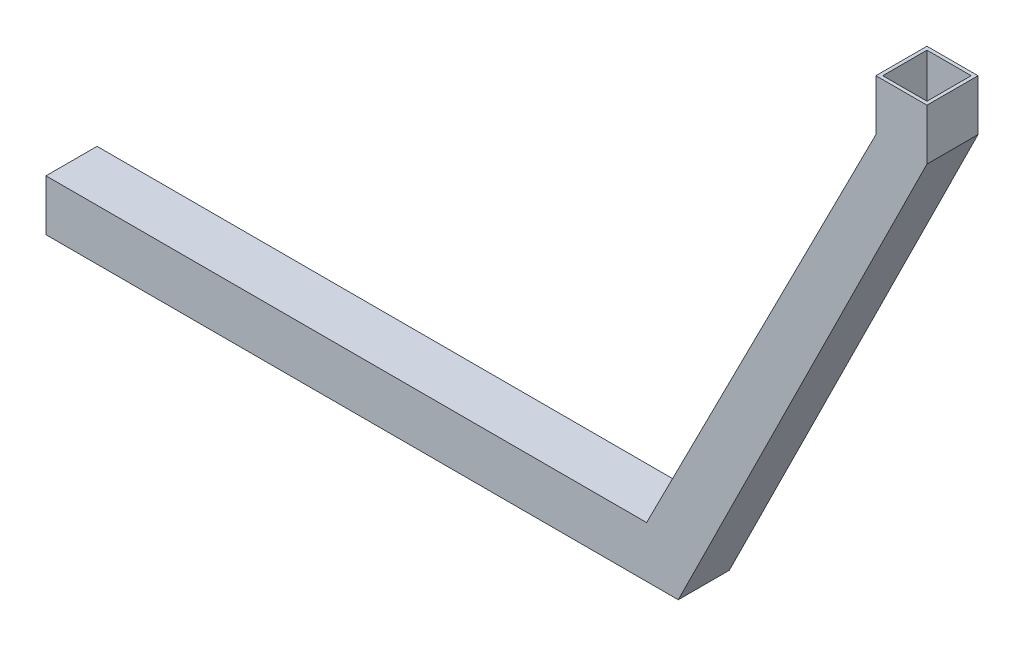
ISO-10303-21;
HEADER;
FILE_DESCRIPTION(('STEP AP214'),'2;1');
FILE_NAME('part.step','',(''),(''),'','','');
FILE_SCHEMA(('AUTOMOTIVE_DESIGN { 1 0 10303 214 1 1 1 1 }'));
ENDSEC;
DATA;
#1=APPLICATION_CONTEXT('core data for automotive mechanical design processes');
#2=APPLICATION_PROTOCOL_DEFINITION('international standard','automotive_design',2000,#1);
#3=PRODUCT_CONTEXT('',#1,'mechanical');
#4=PRODUCT('Part','Part','',(#3));
#5=PRODUCT_RELATED_PRODUCT_CATEGORY('part','',(#4));
#6=PRODUCT_DEFINITION_FORMATION('','',#4);
#7=PRODUCT_DEFINITION_CONTEXT('part definition',#1,'design');
#8=PRODUCT_DEFINITION('design','',#6,#7);
#9=PRODUCT_DEFINITION_SHAPE('','',#8);
#10=(LENGTH_UNIT() NAMED_UNIT(*) SI_UNIT(.MILLI.,.METRE.));
#11=(NAMED_UNIT(*) PLANE_ANGLE_UNIT() SI_UNIT($,.RADIAN.));
#12=(NAMED_UNIT(*) SI_UNIT($,.STERADIAN.) SOLID_ANGLE_UNIT());
#13=UNCERTAINTY_MEASURE_WITH_UNIT(LENGTH_MEASURE(1.E-05),#10,'distance_accuracy_value','');
#14=(GEOMETRIC_REPRESENTATION_CONTEXT(3) GLOBAL_UNCERTAINTY_ASSIGNED_CONTEXT((#13)) GLOBAL_UNIT_ASSIGNED_CONTEXT((#10,
#11,#12)) REPRESENTATION_CONTEXT('',''));
#15=CARTESIAN_POINT('',(0.,0.,0.));
#16=DIRECTION('',(0.,0.,1.));
#17=DIRECTION('',(1.,0.,0.));
#18=AXIS2_PLACEMENT_3D('',#15,#16,#17);
#19=CARTESIAN_POINT('',(299.885684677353,309.800000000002,30.));
#20=DIRECTION('',(0.,-1.,0.));
#21=DIRECTION('',(0.,0.,-1.));
#22=AXIS2_PLACEMENT_3D('',#19,#20,#21);
#23=PLANE('',#22);
#24=DIRECTION('',(-1.,0.,0.));
#25=VECTOR('',#24,1.);
#26=CARTESIAN_POINT('',(299.885684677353,309.800000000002,0.));
#27=LINE('',#26,#25);
#28=CARTESIAN_POINT('',(329.885684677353,309.800000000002,0.));
#29=VERTEX_POINT('',#28);
#30=CARTESIAN_POINT('',(299.885684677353,309.800000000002,0.));
#31=VERTEX_POINT('',#30);
#32=EDGE_CURVE('E246',#29,#31,#27,.T.);
#33=ORIENTED_EDGE('',*,*,#32,.T.);
#34=DIRECTION('',(0.,0.,-1.));
#35=VECTOR('',#34,1.);
#36=CARTESIAN_POINT('',(299.885684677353,309.800000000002,30.));
#37=LINE('',#36,#35);
#38=CARTESIAN_POINT('',(299.885684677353,309.800000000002,30.));
#39=VERTEX_POINT('',#38);
#40=EDGE_CURVE('E261',#39,#31,#37,.T.);
#41=ORIENTED_EDGE('',*,*,#40,.F.);
#42=DIRECTION('',(-1.,0.,0.));
#43=VECTOR('',#42,1.);
#44=CARTESIAN_POINT('',(299.885684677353,309.800000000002,30.));
#45=LINE('',#44,#43);
#46=CARTESIAN_POINT('',(329.885684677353,309.800000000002,30.));
#47=VERTEX_POINT('',#46);
#48=EDGE_CURVE('E229',#47,#39,#45,.T.);
#49=ORIENTED_EDGE('',*,*,#48,.F.);
#50=DIRECTION('',(0.,0.,-1.));
#51=VECTOR('',#50,1.);
#52=CARTESIAN_POINT('',(329.885684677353,309.800000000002,30.));
#53=LINE('',#52,#51);
#54=EDGE_CURVE('E264',#47,#29,#53,.T.);
#55=ORIENTED_EDGE('',*,*,#54,.T.);
#56=EDGE_LOOP('',(#33,#41,#49,#55));
#57=FACE_BOUND('',#56,.T.);
#58=DIRECTION('',(-1.,0.,0.));
#59=VECTOR('',#58,1.);
#60=CARTESIAN_POINT('',(299.885684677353,309.800000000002,2.));
#61=LINE('',#60,#59);
#62=CARTESIAN_POINT('',(327.885684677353,309.800000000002,2.));
#63=VERTEX_POINT('',#62);
#64=CARTESIAN_POINT('',(301.885684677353,309.800000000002,2.));
#65=VERTEX_POINT('',#64);
#66=EDGE_CURVE('E193',#63,#65,#61,.T.);
#67=ORIENTED_EDGE('',*,*,#66,.F.);
#68=DIRECTION('',(0.,0.,-1.));
#69=VECTOR('',#68,1.);
#70=CARTESIAN_POINT('',(327.885684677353,309.800000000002,30.));
#71=LINE('',#70,#69);
#72=CARTESIAN_POINT('',(327.885684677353,309.800000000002,28.));
#73=VERTEX_POINT('',#72);
#74=EDGE_CURVE('E189',#73,#63,#71,.T.);
#75=ORIENTED_EDGE('',*,*,#74,.F.);
#76=DIRECTION('',(-1.,0.,0.));
#77=VECTOR('',#76,1.);
#78=CARTESIAN_POINT('',(299.885684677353,309.800000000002,28.));
#79=LINE('',#78,#77);
#80=CARTESIAN_POINT('',(301.885684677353,309.800000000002,28.));
#81=VERTEX_POINT('',#80);
#82=EDGE_CURVE('E63',#73,#81,#79,.T.);
#83=ORIENTED_EDGE('',*,*,#82,.T.);
#84=DIRECTION('',(0.,0.,-1.));
#85=VECTOR('',#84,1.);
#86=CARTESIAN_POINT('',(301.885684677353,309.800000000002,30.));
#87=LINE('',#86,#85);
#88=EDGE_CURVE('E208',#81,#65,#87,.T.);
#89=ORIENTED_EDGE('',*,*,#88,.T.);
#90=EDGE_LOOP('',(#67,#75,#83,#89));
#91=FACE_BOUND('',#90,.T.);
#92=ADVANCED_FACE('F40',(#57,#91),#23,.F.);
#93=CARTESIAN_POINT('',(-187.814315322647,-14.999999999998,30.));
#94=DIRECTION('',(1.,0.,0.));
#95=DIRECTION('',(0.,0.,-1.));
#96=AXIS2_PLACEMENT_3D('',#93,#94,#95);
#97=PLANE('',#96);
#98=DIRECTION('',(0.,0.,1.));
#99=VECTOR('',#98,1.);
#100=CARTESIAN_POINT('',(-187.814315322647,-12.999999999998,28.));
#101=LINE('',#100,#99);
#102=CARTESIAN_POINT('',(-187.814315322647,-12.9999999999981,2.));
#103=VERTEX_POINT('',#102);
#104=CARTESIAN_POINT('',(-187.814315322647,-12.999999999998,28.));
#105=VERTEX_POINT('',#104);
#106=EDGE_CURVE('E166',#103,#105,#101,.T.);
#107=ORIENTED_EDGE('',*,*,#106,.F.);
#108=DIRECTION('',(0.,-1.,0.));
#109=VECTOR('',#108,1.);
#110=CARTESIAN_POINT('',(-187.814315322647,-12.9999999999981,2.));
#111=LINE('',#110,#109);
#112=CARTESIAN_POINT('',(-187.814315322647,13.0000000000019,2.));
#113=VERTEX_POINT('',#112);
#114=EDGE_CURVE('E170',#113,#103,#111,.T.);
#115=ORIENTED_EDGE('',*,*,#114,.F.);
#116=DIRECTION('',(0.,0.,-1.));
#117=VECTOR('',#116,1.);
#118=CARTESIAN_POINT('',(-187.814315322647,13.0000000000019,28.));
#119=LINE('',#118,#117);
#120=CARTESIAN_POINT('',(-187.814315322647,13.0000000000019,28.));
#121=VERTEX_POINT('',#120);
#122=EDGE_CURVE('E174',#121,#113,#119,.T.);
#123=ORIENTED_EDGE('',*,*,#122,.F.);
#124=DIRECTION('',(0.,1.,0.));
#125=VECTOR('',#124,1.);
#126=CARTESIAN_POINT('',(-187.814315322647,-12.999999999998,28.));
#127=LINE('',#126,#125);
#128=EDGE_CURVE('E159',#105,#121,#127,.T.);
#129=ORIENTED_EDGE('',*,*,#128,.F.);
#130=EDGE_LOOP('',(#107,#115,#123,#129));
#131=FACE_BOUND('',#130,.T.);
#132=DIRECTION('',(0.,-1.,0.));
#133=VECTOR('',#132,1.);
#134=CARTESIAN_POINT('',(-187.814315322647,-14.999999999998,0.));
#135=LINE('',#134,#133);
#136=CARTESIAN_POINT('',(-187.814315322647,15.0000000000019,0.));
#137=VERTEX_POINT('',#136);
#138=CARTESIAN_POINT('',(-187.814315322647,-14.999999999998,0.));
#139=VERTEX_POINT('',#138);
#140=EDGE_CURVE('E182',#137,#139,#135,.T.);
#141=ORIENTED_EDGE('',*,*,#140,.T.);
#142=DIRECTION('',(0.,0.,-1.));
#143=VECTOR('',#142,1.);
#144=CARTESIAN_POINT('',(-187.814315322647,-14.999999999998,30.));
#145=LINE('',#144,#143);
#146=CARTESIAN_POINT('',(-187.814315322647,-14.999999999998,30.));
#147=VERTEX_POINT('',#146);
#148=EDGE_CURVE('E11',#147,#139,#145,.T.);
#149=ORIENTED_EDGE('',*,*,#148,.F.);
#150=DIRECTION('',(0.,-1.,0.));
#151=VECTOR('',#150,1.);
#152=CARTESIAN_POINT('',(-187.814315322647,-14.999999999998,30.));
#153=LINE('',#152,#151);
#154=CARTESIAN_POINT('',(-187.814315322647,15.0000000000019,30.));
#155=VERTEX_POINT('',#154);
#156=EDGE_CURVE('E219',#155,#147,#153,.T.);
#157=ORIENTED_EDGE('',*,*,#156,.F.);
#158=DIRECTION('',(0.,0.,-1.));
#159=VECTOR('',#158,1.);
#160=CARTESIAN_POINT('',(-187.814315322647,15.0000000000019,30.));
#161=LINE('',#160,#159);
#162=EDGE_CURVE('E237',#155,#137,#161,.T.);
#163=ORIENTED_EDGE('',*,*,#162,.T.);
#164=EDGE_LOOP('',(#141,#149,#157,#163));
#165=FACE_BOUND('',#164,.T.);
#166=ADVANCED_FACE('F42',(#131,#165),#97,.F.);
#167=CARTESIAN_POINT('',(142.457793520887,-14.999999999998,30.));
#168=DIRECTION('',(0.,1.,0.));
#169=DIRECTION('',(-1.,0.,0.));
#170=AXIS2_PLACEMENT_3D('',#167,#168,#169);
#171=PLANE('',#170);
#172=DIRECTION('',(1.,0.,0.));
#173=VECTOR('',#172,1.);
#174=CARTESIAN_POINT('',(142.457793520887,-14.999999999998,0.));
#175=LINE('',#174,#173);
#176=CARTESIAN_POINT('',(183.748297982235,-14.999999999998,0.));
#177=VERTEX_POINT('',#176);
#178=EDGE_CURVE('E240',#139,#177,#175,.T.);
#179=ORIENTED_EDGE('',*,*,#178,.T.);
#180=DIRECTION('',(0.,0.,-1.));
#181=VECTOR('',#180,1.);
#182=CARTESIAN_POINT('',(183.748297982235,-14.999999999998,30.));
#183=LINE('',#182,#181);
#184=CARTESIAN_POINT('',(183.748297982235,-14.999999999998,30.));
#185=VERTEX_POINT('',#184);
#186=EDGE_CURVE('E48',#185,#177,#183,.T.);
#187=ORIENTED_EDGE('',*,*,#186,.F.);
#188=DIRECTION('',(1.,0.,0.));
#189=VECTOR('',#188,1.);
#190=CARTESIAN_POINT('',(142.457793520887,-14.999999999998,30.));
#191=LINE('',#190,#189);
#192=EDGE_CURVE('E222',#147,#185,#191,.T.);
#193=ORIENTED_EDGE('',*,*,#192,.F.);
#194=ORIENTED_EDGE('',*,*,#148,.T.);
#195=EDGE_LOOP('',(#179,#187,#193,#194));
#196=FACE_BOUND('',#195,.T.);
#197=ADVANCED_FACE('F297',(#196),#171,.F.);
#198=CARTESIAN_POINT('',(183.748297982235,-14.999999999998,30.));
#199=DIRECTION('',(-0.895956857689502,0.444141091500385,0.));
#200=DIRECTION('',(-0.444141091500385,-0.895956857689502,0.));
#201=AXIS2_PLACEMENT_3D('',#198,#199,#200);
#202=PLANE('',#201);
#203=DIRECTION('',(0.444141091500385,0.895956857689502,0.));
#204=VECTOR('',#203,1.);
#205=CARTESIAN_POINT('',(183.748297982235,-14.999999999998,0.));
#206=LINE('',#205,#204);
#207=CARTESIAN_POINT('',(329.885684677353,279.800000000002,0.));
#208=VERTEX_POINT('',#207);
#209=EDGE_CURVE('E242',#177,#208,#206,.T.);
#210=ORIENTED_EDGE('',*,*,#209,.T.);
#211=DIRECTION('',(0.,0.,-1.));
#212=VECTOR('',#211,1.);
#213=CARTESIAN_POINT('',(329.885684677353,279.800000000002,30.));
#214=LINE('',#213,#212);
#215=CARTESIAN_POINT('',(329.885684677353,279.800000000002,30.));
#216=VERTEX_POINT('',#215);
#217=EDGE_CURVE('E267',#216,#208,#214,.T.);
#218=ORIENTED_EDGE('',*,*,#217,.F.);
#219=DIRECTION('',(0.444141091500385,0.895956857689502,0.));
#220=VECTOR('',#219,1.);
#221=CARTESIAN_POINT('',(183.748297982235,-14.999999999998,30.));
#222=LINE('',#221,#220);
#223=EDGE_CURVE('E225',#185,#216,#222,.T.);
#224=ORIENTED_EDGE('',*,*,#223,.F.);
#225=ORIENTED_EDGE('',*,*,#186,.T.);
#226=EDGE_LOOP('',(#210,#218,#224,#225));
#227=FACE_BOUND('',#226,.T.);
#228=ADVANCED_FACE('F274',(#227),#202,.F.);
#229=CARTESIAN_POINT('',(329.885684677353,309.800000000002,30.));
#230=DIRECTION('',(-1.,0.,0.));
#231=DIRECTION('',(0.,-1.,0.));
#232=AXIS2_PLACEMENT_3D('',#229,#230,#231);
#233=PLANE('',#232);
#234=DIRECTION('',(0.,1.,0.));
#235=VECTOR('',#234,1.);
#236=CARTESIAN_POINT('',(329.885684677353,309.800000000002,0.));
#237=LINE('',#236,#235);
#238=EDGE_CURVE('E244',#208,#29,#237,.T.);
#239=ORIENTED_EDGE('',*,*,#238,.T.);
#240=ORIENTED_EDGE('',*,*,#54,.F.);
#241=DIRECTION('',(0.,1.,0.));
#242=VECTOR('',#241,1.);
#243=CARTESIAN_POINT('',(329.885684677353,309.800000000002,30.));
#244=LINE('',#243,#242);
#245=EDGE_CURVE('E227',#216,#47,#244,.T.);
#246=ORIENTED_EDGE('',*,*,#245,.F.);
#247=ORIENTED_EDGE('',*,*,#217,.T.);
#248=EDGE_LOOP('',(#239,#240,#246,#247));
#249=FACE_BOUND('',#248,.T.);
#250=ADVANCED_FACE('F285',(#249),#233,.F.);
#251=CARTESIAN_POINT('',(299.885684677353,279.800000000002,30.));
#252=DIRECTION('',(1.,0.,0.));
#253=DIRECTION('',(0.,0.,-1.));
#254=AXIS2_PLACEMENT_3D('',#251,#252,#253);
#255=PLANE('',#254);
#256=DIRECTION('',(0.,-1.,0.));
#257=VECTOR('',#256,1.);
#258=CARTESIAN_POINT('',(299.885684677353,279.800000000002,0.));
#259=LINE('',#258,#257);
#260=CARTESIAN_POINT('',(299.885684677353,279.800000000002,0.));
#261=VERTEX_POINT('',#260);
#262=EDGE_CURVE('E248',#31,#261,#259,.T.);
#263=ORIENTED_EDGE('',*,*,#262,.T.);
#264=DIRECTION('',(0.,0.,-1.));
#265=VECTOR('',#264,1.);
#266=CARTESIAN_POINT('',(299.885684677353,279.800000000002,30.));
#267=LINE('',#266,#265);
#268=CARTESIAN_POINT('',(299.885684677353,279.800000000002,30.));
#269=VERTEX_POINT('',#268);
#270=EDGE_CURVE('E258',#269,#261,#267,.T.);
#271=ORIENTED_EDGE('',*,*,#270,.F.);
#272=DIRECTION('',(0.,-1.,0.));
#273=VECTOR('',#272,1.);
#274=CARTESIAN_POINT('',(299.885684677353,279.800000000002,30.));
#275=LINE('',#274,#273);
#276=EDGE_CURVE('E231',#39,#269,#275,.T.);
#277=ORIENTED_EDGE('',*,*,#276,.F.);
#278=ORIENTED_EDGE('',*,*,#40,.T.);
#279=EDGE_LOOP('',(#263,#271,#277,#278));
#280=FACE_BOUND('',#279,.T.);
#281=ADVANCED_FACE('F309',(#280),#255,.F.);
#282=CARTESIAN_POINT('',(299.885684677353,279.800000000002,30.));
#283=DIRECTION('',(0.891241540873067,-0.45352895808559,0.));
#284=DIRECTION('',(0.45352895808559,0.891241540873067,0.));
#285=AXIS2_PLACEMENT_3D('',#282,#283,#284);
#286=PLANE('',#285);
#287=DIRECTION('',(-0.45352895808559,-0.891241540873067,0.));
#288=VECTOR('',#287,1.);
#289=CARTESIAN_POINT('',(299.885684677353,279.800000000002,0.));
#290=LINE('',#289,#288);
#291=CARTESIAN_POINT('',(165.136054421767,15.000000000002,0.));
#292=VERTEX_POINT('',#291);
#293=EDGE_CURVE('E250',#261,#292,#290,.T.);
#294=ORIENTED_EDGE('',*,*,#293,.T.);
#295=DIRECTION('',(0.,0.,-1.));
#296=VECTOR('',#295,1.);
#297=CARTESIAN_POINT('',(165.136054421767,15.000000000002,30.));
#298=LINE('',#297,#296);
#299=CARTESIAN_POINT('',(165.136054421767,15.000000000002,30.));
#300=VERTEX_POINT('',#299);
#301=EDGE_CURVE('E255',#300,#292,#298,.T.);
#302=ORIENTED_EDGE('',*,*,#301,.F.);
#303=DIRECTION('',(-0.45352895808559,-0.891241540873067,0.));
#304=VECTOR('',#303,1.);
#305=CARTESIAN_POINT('',(299.885684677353,279.800000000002,30.));
#306=LINE('',#305,#304);
#307=EDGE_CURVE('E233',#269,#300,#306,.T.);
#308=ORIENTED_EDGE('',*,*,#307,.F.);
#309=ORIENTED_EDGE('',*,*,#270,.T.);
#310=EDGE_LOOP('',(#294,#302,#308,#309));
#311=FACE_BOUND('',#310,.T.);
#312=ADVANCED_FACE('F307',(#311),#286,.F.);
#313=CARTESIAN_POINT('',(165.136054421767,15.000000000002,30.));
#314=DIRECTION('',(0.,-1.,0.));
#315=DIRECTION('',(1.,0.,0.));
#316=AXIS2_PLACEMENT_3D('',#313,#314,#315);
#317=PLANE('',#316);
#318=DIRECTION('',(-1.,0.,0.));
#319=VECTOR('',#318,1.);
#320=CARTESIAN_POINT('',(165.136054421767,15.000000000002,0.));
#321=LINE('',#320,#319);
#322=EDGE_CURVE('E223',#292,#137,#321,.T.);
#323=ORIENTED_EDGE('',*,*,#322,.T.);
#324=ORIENTED_EDGE('',*,*,#162,.F.);
#325=DIRECTION('',(-1.,0.,0.));
#326=VECTOR('',#325,1.);
#327=CARTESIAN_POINT('',(165.136054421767,15.000000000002,30.));
#328=LINE('',#327,#326);
#329=EDGE_CURVE('E235',#300,#155,#328,.T.);
#330=ORIENTED_EDGE('',*,*,#329,.F.);
#331=ORIENTED_EDGE('',*,*,#301,.T.);
#332=EDGE_LOOP('',(#323,#324,#330,#331));
#333=FACE_BOUND('',#332,.T.);
#334=ADVANCED_FACE('F302',(#333),#317,.F.);
#335=CARTESIAN_POINT('',(0.,0.,30.));
#336=DIRECTION('',(0.,0.,1.));
#337=DIRECTION('',(1.,0.,0.));
#338=AXIS2_PLACEMENT_3D('',#335,#336,#337);
#339=PLANE('',#338);
#340=ORIENTED_EDGE('',*,*,#156,.T.);
#341=ORIENTED_EDGE('',*,*,#192,.T.);
#342=ORIENTED_EDGE('',*,*,#223,.T.);
#343=ORIENTED_EDGE('',*,*,#245,.T.);
#344=ORIENTED_EDGE('',*,*,#48,.T.);
#345=ORIENTED_EDGE('',*,*,#276,.T.);
#346=ORIENTED_EDGE('',*,*,#307,.T.);
#347=ORIENTED_EDGE('',*,*,#329,.T.);
#348=EDGE_LOOP('',(#340,#341,#342,#343,#344,#345,#346,#347));
#349=FACE_BOUND('',#348,.T.);
#350=ADVANCED_FACE('F293',(#349),#339,.T.);
#351=CARTESIAN_POINT('',(0.,0.,0.));
#352=DIRECTION('',(0.,0.,1.));
#353=DIRECTION('',(1.,0.,0.));
#354=AXIS2_PLACEMENT_3D('',#351,#352,#353);
#355=PLANE('',#354);
#356=ORIENTED_EDGE('',*,*,#140,.F.);
#357=ORIENTED_EDGE('',*,*,#322,.F.);
#358=ORIENTED_EDGE('',*,*,#293,.F.);
#359=ORIENTED_EDGE('',*,*,#262,.F.);
#360=ORIENTED_EDGE('',*,*,#32,.F.);
#361=ORIENTED_EDGE('',*,*,#238,.F.);
#362=ORIENTED_EDGE('',*,*,#209,.F.);
#363=ORIENTED_EDGE('',*,*,#178,.F.);
#364=EDGE_LOOP('',(#356,#357,#358,#359,#360,#361,#362,#363));
#365=FACE_BOUND('',#364,.T.);
#366=ADVANCED_FACE('F280',(#365),#355,.F.);
#367=CARTESIAN_POINT('',(142.457793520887,-12.999999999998,30.));
#368=DIRECTION('',(0.,1.,0.));
#369=DIRECTION('',(-1.,0.,0.));
#370=AXIS2_PLACEMENT_3D('',#367,#368,#369);
#371=PLANE('',#370);
#372=DIRECTION('',(1.,0.,0.));
#373=VECTOR('',#372,1.);
#374=CARTESIAN_POINT('',(142.457793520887,-12.999999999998,28.));
#375=LINE('',#374,#373);
#376=CARTESIAN_POINT('',(182.50748174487,-12.999999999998,28.));
#377=VERTEX_POINT('',#376);
#378=EDGE_CURVE('E155',#105,#377,#375,.T.);
#379=ORIENTED_EDGE('',*,*,#378,.T.);
#380=DIRECTION('',(0.,0.,-1.));
#381=VECTOR('',#380,1.);
#382=CARTESIAN_POINT('',(182.50748174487,-12.999999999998,30.));
#383=LINE('',#382,#381);
#384=CARTESIAN_POINT('',(182.50748174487,-12.999999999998,2.));
#385=VERTEX_POINT('',#384);
#386=EDGE_CURVE('E181',#377,#385,#383,.T.);
#387=ORIENTED_EDGE('',*,*,#386,.T.);
#388=DIRECTION('',(1.,0.,0.));
#389=VECTOR('',#388,1.);
#390=CARTESIAN_POINT('',(142.457793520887,-12.999999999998,2.));
#391=LINE('',#390,#389);
#392=EDGE_CURVE('E55',#103,#385,#391,.T.);
#393=ORIENTED_EDGE('',*,*,#392,.F.);
#394=ORIENTED_EDGE('',*,*,#106,.T.);
#395=EDGE_LOOP('',(#379,#387,#393,#394));
#396=FACE_BOUND('',#395,.T.);
#397=ADVANCED_FACE('F167',(#396),#371,.T.);
#398=CARTESIAN_POINT('',(181.956384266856,-14.1117178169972,30.));
#399=DIRECTION('',(-0.895956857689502,0.444141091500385,0.));
#400=DIRECTION('',(-0.444141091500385,-0.895956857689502,0.));
#401=AXIS2_PLACEMENT_3D('',#398,#399,#400);
#402=PLANE('',#401);
#403=DIRECTION('',(0.444141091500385,0.895956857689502,0.));
#404=VECTOR('',#403,1.);
#405=CARTESIAN_POINT('',(181.956384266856,-14.1117178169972,2.));
#406=LINE('',#405,#404);
#407=CARTESIAN_POINT('',(327.885684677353,280.268513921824,2.));
#408=VERTEX_POINT('',#407);
#409=EDGE_CURVE('E180',#385,#408,#406,.T.);
#410=ORIENTED_EDGE('',*,*,#409,.F.);
#411=ORIENTED_EDGE('',*,*,#386,.F.);
#412=DIRECTION('',(0.444141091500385,0.895956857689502,0.));
#413=VECTOR('',#412,1.);
#414=CARTESIAN_POINT('',(181.956384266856,-14.1117178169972,28.));
#415=LINE('',#414,#413);
#416=CARTESIAN_POINT('',(327.885684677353,280.268513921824,28.));
#417=VERTEX_POINT('',#416);
#418=EDGE_CURVE('E161',#377,#417,#415,.T.);
#419=ORIENTED_EDGE('',*,*,#418,.T.);
#420=DIRECTION('',(0.,0.,-1.));
#421=VECTOR('',#420,1.);
#422=CARTESIAN_POINT('',(327.885684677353,280.268513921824,30.));
#423=LINE('',#422,#421);
#424=EDGE_CURVE('E183',#417,#408,#423,.T.);
#425=ORIENTED_EDGE('',*,*,#424,.T.);
#426=EDGE_LOOP('',(#410,#411,#419,#425));
#427=FACE_BOUND('',#426,.T.);
#428=ADVANCED_FACE('F384',(#427),#402,.T.);
#429=CARTESIAN_POINT('',(327.885684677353,309.800000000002,30.));
#430=DIRECTION('',(-1.,0.,0.));
#431=DIRECTION('',(0.,-1.,0.));
#432=AXIS2_PLACEMENT_3D('',#429,#430,#431);
#433=PLANE('',#432);
#434=DIRECTION('',(0.,1.,0.));
#435=VECTOR('',#434,1.);
#436=CARTESIAN_POINT('',(327.885684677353,309.800000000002,2.));
#437=LINE('',#436,#435);
#438=EDGE_CURVE('E186',#408,#63,#437,.T.);
#439=ORIENTED_EDGE('',*,*,#438,.F.);
#440=ORIENTED_EDGE('',*,*,#424,.F.);
#441=DIRECTION('',(0.,1.,0.));
#442=VECTOR('',#441,1.);
#443=CARTESIAN_POINT('',(327.885684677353,309.800000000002,28.));
#444=LINE('',#443,#442);
#445=EDGE_CURVE('E191',#417,#73,#444,.T.);
#446=ORIENTED_EDGE('',*,*,#445,.T.);
#447=ORIENTED_EDGE('',*,*,#74,.T.);
#448=EDGE_LOOP('',(#439,#440,#446,#447));
#449=FACE_BOUND('',#448,.T.);
#450=ADVANCED_FACE('F389',(#449),#433,.T.);
#451=CARTESIAN_POINT('',(301.885684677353,279.800000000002,30.));
#452=DIRECTION('',(1.,0.,0.));
#453=DIRECTION('',(0.,0.,-1.));
#454=AXIS2_PLACEMENT_3D('',#451,#452,#453);
#455=PLANE('',#454);
#456=DIRECTION('',(0.,-1.,0.));
#457=VECTOR('',#456,1.);
#458=CARTESIAN_POINT('',(301.885684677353,279.800000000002,2.));
#459=LINE('',#458,#457);
#460=CARTESIAN_POINT('',(301.885684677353,279.320390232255,2.));
#461=VERTEX_POINT('',#460);
#462=EDGE_CURVE('E202',#65,#461,#459,.T.);
#463=ORIENTED_EDGE('',*,*,#462,.F.);
#464=ORIENTED_EDGE('',*,*,#88,.F.);
#465=DIRECTION('',(0.,-1.,0.));
#466=VECTOR('',#465,1.);
#467=CARTESIAN_POINT('',(301.885684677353,279.800000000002,28.));
#468=LINE('',#467,#466);
#469=CARTESIAN_POINT('',(301.885684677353,279.320390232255,28.));
#470=VERTEX_POINT('',#469);
#471=EDGE_CURVE('E195',#81,#470,#468,.T.);
#472=ORIENTED_EDGE('',*,*,#471,.T.);
#473=DIRECTION('',(0.,0.,-1.));
#474=VECTOR('',#473,1.);
#475=CARTESIAN_POINT('',(301.885684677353,279.320390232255,30.));
#476=LINE('',#475,#474);
#477=EDGE_CURVE('E205',#470,#461,#476,.T.);
#478=ORIENTED_EDGE('',*,*,#477,.T.);
#479=EDGE_LOOP('',(#463,#464,#472,#478));
#480=FACE_BOUND('',#479,.T.);
#481=ADVANCED_FACE('F400',(#480),#455,.T.);
#482=CARTESIAN_POINT('',(301.668167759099,278.892942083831,30.));
#483=DIRECTION('',(0.891241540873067,-0.45352895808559,0.));
#484=DIRECTION('',(0.45352895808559,0.891241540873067,0.));
#485=AXIS2_PLACEMENT_3D('',#482,#483,#484);
#486=PLANE('',#485);
#487=DIRECTION('',(-0.45352895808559,-0.891241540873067,0.));
#488=VECTOR('',#487,1.);
#489=CARTESIAN_POINT('',(301.668167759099,278.892942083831,2.));
#490=LINE('',#489,#488);
#491=CARTESIAN_POINT('',(166.362368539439,13.000000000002,2.));
#492=VERTEX_POINT('',#491);
#493=EDGE_CURVE('E204',#461,#492,#490,.T.);
#494=ORIENTED_EDGE('',*,*,#493,.F.);
#495=ORIENTED_EDGE('',*,*,#477,.F.);
#496=DIRECTION('',(-0.45352895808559,-0.891241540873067,0.));
#497=VECTOR('',#496,1.);
#498=CARTESIAN_POINT('',(301.668167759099,278.892942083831,28.));
#499=LINE('',#498,#497);
#500=CARTESIAN_POINT('',(166.362368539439,13.000000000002,28.));
#501=VERTEX_POINT('',#500);
#502=EDGE_CURVE('E197',#470,#501,#499,.T.);
#503=ORIENTED_EDGE('',*,*,#502,.T.);
#504=DIRECTION('',(0.,0.,-1.));
#505=VECTOR('',#504,1.);
#506=CARTESIAN_POINT('',(166.362368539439,13.000000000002,30.));
#507=LINE('',#506,#505);
#508=EDGE_CURVE('E201',#501,#492,#507,.T.);
#509=ORIENTED_EDGE('',*,*,#508,.T.);
#510=EDGE_LOOP('',(#494,#495,#503,#509));
#511=FACE_BOUND('',#510,.T.);
#512=ADVANCED_FACE('F410',(#511),#486,.T.);
#513=CARTESIAN_POINT('',(165.136054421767,13.000000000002,30.));
#514=DIRECTION('',(0.,-1.,0.));
#515=DIRECTION('',(1.,0.,0.));
#516=AXIS2_PLACEMENT_3D('',#513,#514,#515);
#517=PLANE('',#516);
#518=ORIENTED_EDGE('',*,*,#122,.T.);
#519=DIRECTION('',(-1.,0.,0.));
#520=VECTOR('',#519,1.);
#521=CARTESIAN_POINT('',(165.136054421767,13.000000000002,2.));
#522=LINE('',#521,#520);
#523=EDGE_CURVE('E163',#492,#113,#522,.T.);
#524=ORIENTED_EDGE('',*,*,#523,.F.);
#525=ORIENTED_EDGE('',*,*,#508,.F.);
#526=DIRECTION('',(-1.,0.,0.));
#527=VECTOR('',#526,1.);
#528=CARTESIAN_POINT('',(165.136054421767,13.000000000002,28.));
#529=LINE('',#528,#527);
#530=EDGE_CURVE('E199',#501,#121,#529,.T.);
#531=ORIENTED_EDGE('',*,*,#530,.T.);
#532=EDGE_LOOP('',(#518,#524,#525,#531));
#533=FACE_BOUND('',#532,.T.);
#534=ADVANCED_FACE('F419',(#533),#517,.T.);
#535=CARTESIAN_POINT('',(0.,0.,28.));
#536=DIRECTION('',(0.,0.,1.));
#537=DIRECTION('',(1.,0.,0.));
#538=AXIS2_PLACEMENT_3D('',#535,#536,#537);
#539=PLANE('',#538);
#540=ORIENTED_EDGE('',*,*,#128,.T.);
#541=ORIENTED_EDGE('',*,*,#530,.F.);
#542=ORIENTED_EDGE('',*,*,#502,.F.);
#543=ORIENTED_EDGE('',*,*,#471,.F.);
#544=ORIENTED_EDGE('',*,*,#82,.F.);
#545=ORIENTED_EDGE('',*,*,#445,.F.);
#546=ORIENTED_EDGE('',*,*,#418,.F.);
#547=ORIENTED_EDGE('',*,*,#378,.F.);
#548=EDGE_LOOP('',(#540,#541,#542,#543,#544,#545,#546,#547));
#549=FACE_BOUND('',#548,.T.);
#550=ADVANCED_FACE('F156',(#549),#539,.F.);
#551=CARTESIAN_POINT('',(0.,0.,2.));
#552=DIRECTION('',(0.,0.,1.));
#553=DIRECTION('',(1.,0.,0.));
#554=AXIS2_PLACEMENT_3D('',#551,#552,#553);
#555=PLANE('',#554);
#556=ORIENTED_EDGE('',*,*,#392,.T.);
#557=ORIENTED_EDGE('',*,*,#409,.T.);
#558=ORIENTED_EDGE('',*,*,#438,.T.);
#559=ORIENTED_EDGE('',*,*,#66,.T.);
#560=ORIENTED_EDGE('',*,*,#462,.T.);
#561=ORIENTED_EDGE('',*,*,#493,.T.);
#562=ORIENTED_EDGE('',*,*,#523,.T.);
#563=ORIENTED_EDGE('',*,*,#114,.T.);
#564=EDGE_LOOP('',(#556,#557,#558,#559,#560,#561,#562,#563));
#565=FACE_BOUND('',#564,.T.);
#566=ADVANCED_FACE('F453',(#565),#555,.T.);
#567=CLOSED_SHELL('',(#92,#166,#197,#228,#250,#281,#312,#334,#350,#366,#397,#428,#450,#481,#512,
#534,#550,#566));
#568=MANIFOLD_SOLID_BREP('B2',#567);
#569=ADVANCED_BREP_SHAPE_REPRESENTATION('',(#18,#568),#14);
#570=SHAPE_DEFINITION_REPRESENTATION(#9,#569);
ENDSEC;
END-ISO-10303-21;
